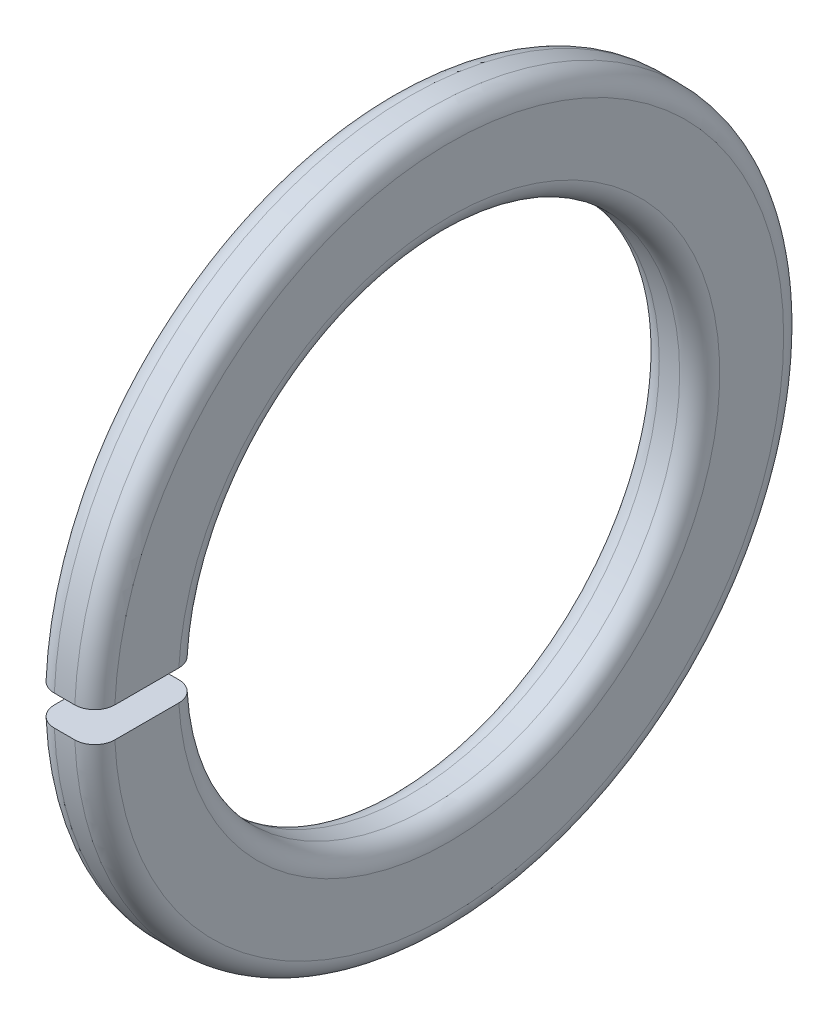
from build123d import *

# Parameters (mm, degrees)
SKETCH2_W = 4
SKETCH2_H = 47.838
GAP_DEPTH = 67.807334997


with BuildPart() as part:
    # Sketch1 → Base-Revolve (revolve)
    with BuildSketch(Plane.XY, mode=Mode.PRIVATE) as base_revolve_sk:
        with BuildLine():
            Line((0, 35.8), (0, 44.25))
            ThreePointArc((0, 44.25), (-0.77616703, 46.12383297), (-2.65, 46.9))
            Line((-2.65, 46.9), (-5.35, 46.9))
            ThreePointArc((-5.35, 46.9), (-7.22383297, 46.12383297), (-8, 44.25))
            Line((-8, 44.25), (-8, 35.8))
            ThreePointArc((-8, 35.8), (-7.22383297, 33.92616703), (-5.35, 33.15))
            Line((-5.35, 33.15), (-2.65, 33.15))
            ThreePointArc((-2.65, 33.15), (-0.77616703, 33.92616703), (0, 35.8))
        make_face()
    revolve(base_revolve_sk.sketch.rotate(Axis((-34.925, 0, 0), (1, 0, 0)), 90), axis=Axis((-34.925, 0, 0), (1, 0, 0)))

    # Sketch2 → Gap (cut, through all)
    with BuildSketch(Plane(origin=(0, 0, 0), x_dir=(0, -1, 0), z_dir=(-1, 0, 0))):
        with Locations((0, 23.919)):
            Rectangle(SKETCH2_W, SKETCH2_H)
    extrude(amount=GAP_DEPTH, mode=Mode.SUBTRACT)


solid = part.part
